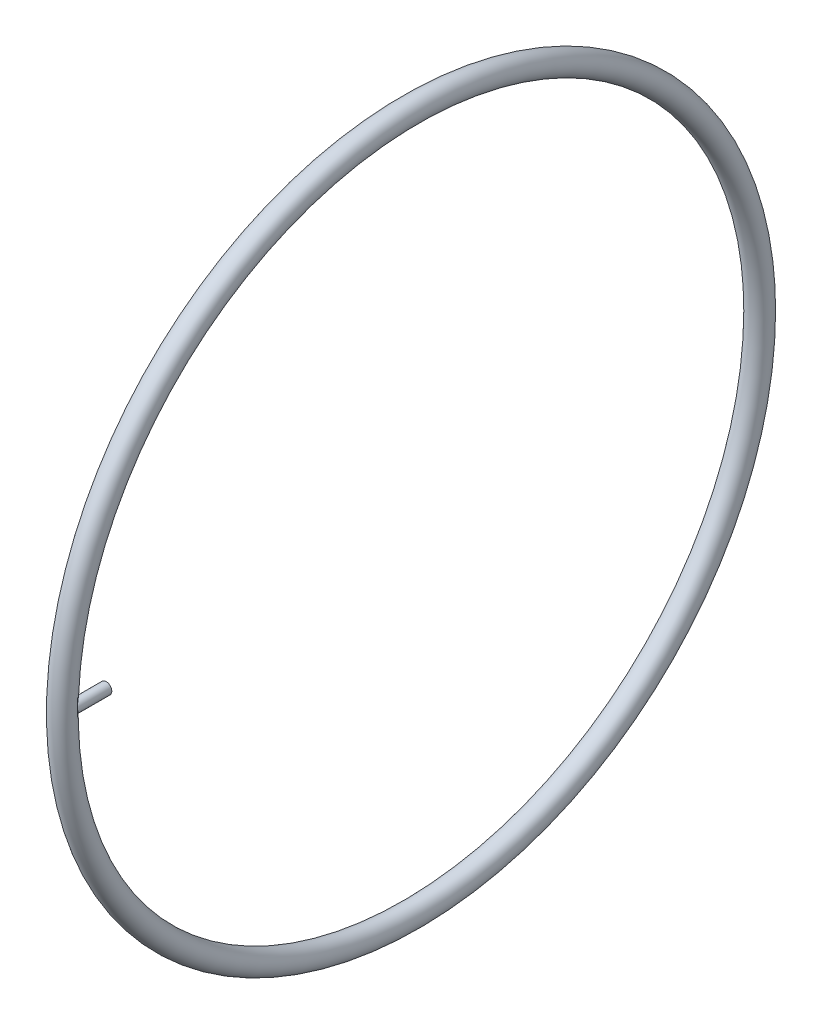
from build123d import *

# Parameters (mm, degrees)
SKETCH1_R                      = 10
SKETCH1_R_2                    = 9
BOSS_EXTRUDE1_REACH            = 674.147
BOSS_EXTRUDE1_END_MAJOR_RADIUS = 310
BOSS_EXTRUDE1_END_MINOR_RADIUS = 10
VALVA_R                        = 5
CUT_EXTRUDE1_REACH             = 674.147
CUT_EXTRUDE1_END_MAJOR_RADIUS  = 310
CUT_EXTRUDE1_END_MINOR_RADIUS  = 9
SKETCH4_R                      = 4


with BuildPart() as part:
    # camera: sweep along a path in Sketch2
    with BuildLine(Plane(origin=(0, 0, 0), x_dir=(0, 0, -1), z_dir=(1, 0, 0))) as camera_path:
        CenterArc((0, 0), 341.057432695, 0, 360)
    # Sketch1 → camera (sweep)
    with BuildSketch(Plane(origin=(0, 0, 0), x_dir=(1, 0, 0), z_dir=(0, 1, 0))):
        with Locations((0, 310)):
            Circle(SKETCH1_R)
        with Locations((0, 310)):
            Circle(SKETCH1_R_2, mode=Mode.SUBTRACT)
    sweep(path=camera_path.line)

    # Boss-Extrude1: up to this torus (the profile starts outside it)
    boss_extrude1_end = Plane(origin=(0, 0, 0), z_dir=(-1, 0, 0)) * Torus(BOSS_EXTRUDE1_END_MAJOR_RADIUS, BOSS_EXTRUDE1_END_MINOR_RADIUS, mode=Mode.PRIVATE)
    # valva → Boss-Extrude1 (add, up to the surface)
    with BuildSketch(Plane.XY.offset(271), mode=Mode.PRIVATE) as boss_extrude1_sk1:
        with Locations(Location((0, 0, 0), (0, 0, 226.599282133))):
            Circle(VALVA_R)
    boss_extrude1_tool1 = extrude(boss_extrude1_sk1.sketch, amount=BOSS_EXTRUDE1_REACH, mode=Mode.PRIVATE) - boss_extrude1_end
    add(boss_extrude1_tool1.solids().sort_by_distance((0, 0, 271))[0])

    # Cut-Extrude1: up to this torus (the profile starts outside it)
    cut_extrude1_end = Plane(origin=(0, 0, 0), z_dir=(-1, 0, 0)) * Torus(CUT_EXTRUDE1_END_MAJOR_RADIUS, CUT_EXTRUDE1_END_MINOR_RADIUS, mode=Mode.PRIVATE)
    # Sketch4 → Cut-Extrude1 (cut, up to the surface)
    with BuildSketch(Plane(origin=(0, 0, 271), x_dir=(-1, 0, 0), z_dir=(0, 0, -1)), mode=Mode.PRIVATE) as cut_extrude1_sk1:
        Circle(SKETCH4_R)
    cut_extrude1_tool1 = extrude(cut_extrude1_sk1.sketch, amount=-CUT_EXTRUDE1_REACH, mode=Mode.PRIVATE) - cut_extrude1_end
    add(cut_extrude1_tool1.solids().sort_by_distance((0, 0, 271))[0], mode=Mode.SUBTRACT)


solid = part.part
